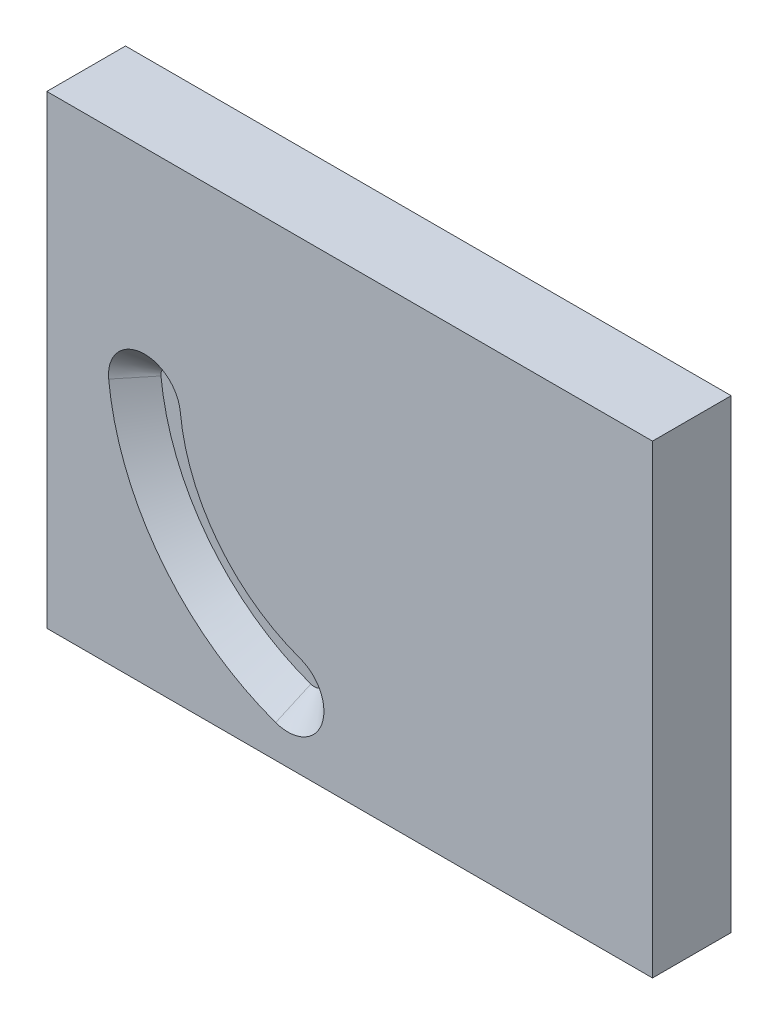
from build123d import *

# Parameters (mm, degrees)
SKIZZE1_W                       = 115.496019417
SKIZZE1_H                       = 88.665728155
LINEAR_AUSTRAGEN1_DEPTH         = 15
SCHNITT_LINEAR_AUSTRAGEN1_DEPTH = 5
SCHNITT_LINEAR_AUSTRAGEN1_DRAFT = -45


with BuildPart() as part:
    # Skizze1 → Linear austragen1 (new body)
    with BuildSketch(Plane.XY):
        with Locations((57.748009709, 44.332864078)):
            Rectangle(SKIZZE1_W, SKIZZE1_H)
    extrude(amount=-LINEAR_AUSTRAGEN1_DEPTH)


with BuildPart() as schnitt_linear_austragen1_tool:
    # Skizze1_4 → Schnitt-Linear austragen1 (with draft: the straight prism first)
    with BuildSketch(Plane.XY):
        with BuildLine():
            ThreePointArc((11.793976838, 47.051129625), (21.839708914, 22.064993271), (43.643503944, 6.259352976))
            ThreePointArc((43.643503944, 6.259352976), (52.431775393, 10.383739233), (48.307389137, 19.172010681))
            ThreePointArc((48.307389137, 19.172010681), (32.66103595, 30.514101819), (25.452241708, 48.444095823))
            ThreePointArc((25.452241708, 48.444095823), (17.926626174, 54.576745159), (11.793976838, 47.051129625))
        make_face()
    extrude(amount=-SCHNITT_LINEAR_AUSTRAGEN1_DEPTH)
    # Schnitt-Linear austragen1: the draft: its side faces are tilted about the plane it starts from
    schnitt_linear_austragen1_sides = [schnitt_linear_austragen1_tool.faces().sort_by_distance(p)[0] for p in [
        (21.839708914, 22.064993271, -2.5),
        (52.431775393, 10.383739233, -2.5),
        (32.66103595, 30.514101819, -2.5),
        (17.926626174, 54.576745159, -2.5),
    ]]
    draft(schnitt_linear_austragen1_sides, Plane.XY, SCHNITT_LINEAR_AUSTRAGEN1_DRAFT)


with BuildPart() as part_1:
    add(part.part)

    # Schnitt-Linear austragen1: cut by schnitt_linear_austragen1_tool
    add(schnitt_linear_austragen1_tool.part, mode=Mode.SUBTRACT)


solid = part_1.part
